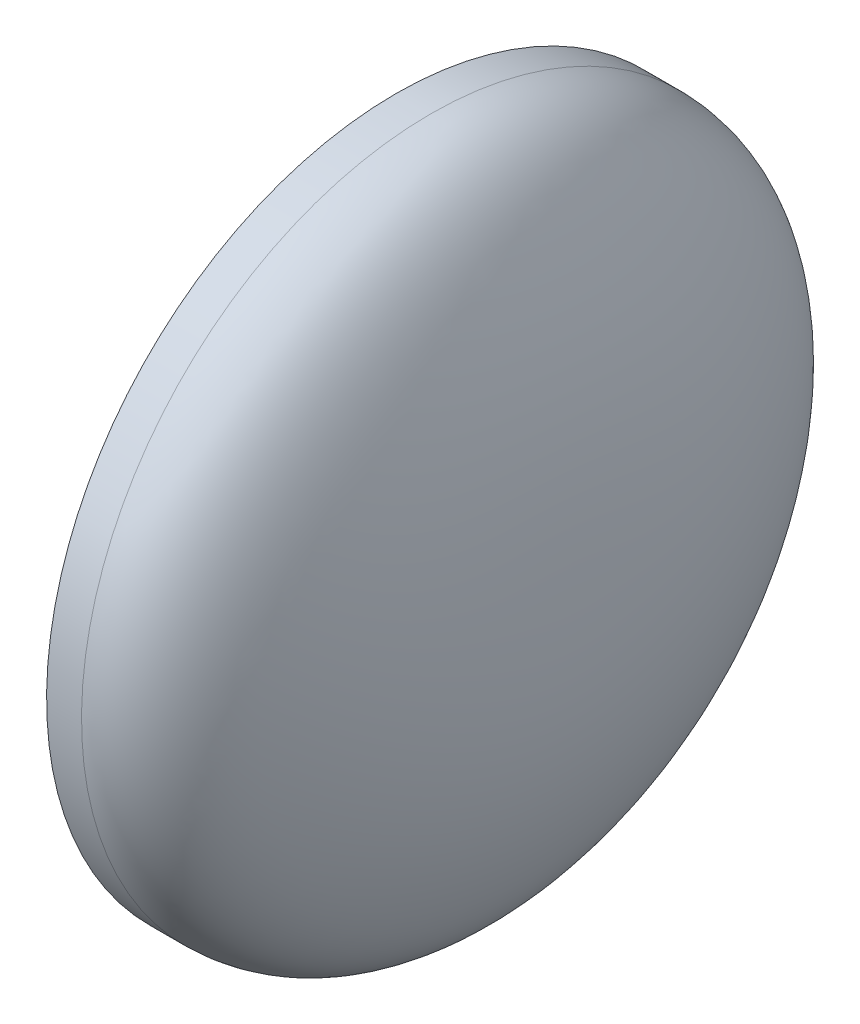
from build123d import *


with BuildPart() as part:
    # Sketch 1 → Revolve 1 (revolve)
    with BuildSketch(Plane.XY):
        with BuildLine():
            Line((0, 0), (0, 5))
            Line((0, 5), (0.5, 5))
            add(Edge.make_bspline(
                [(0.5, 5), (1.252481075, 5), (2.382036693, 3.050481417), (2.5, 1.276109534), (2.5, 0)],
                knots=[0, 0, 0, 0, 0.336053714, 1, 1, 1, 1], degree=3))
            Line((2.5, 0), (0, 0))
        make_face()
    revolve(axis=Axis((2.5, 0, 0), (-1, 0, 0)))


solid = part.part
